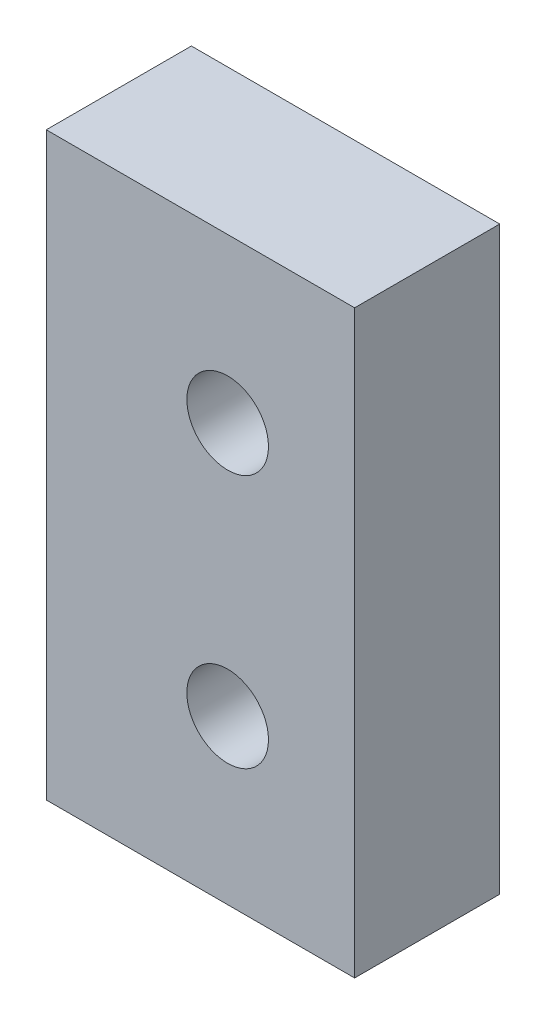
from build123d import *

# Parameters (mm, degrees)
SKETCH_2_W      = 17
SKETCH_2_H      = 32
SKETCH_2_R      = 2.25
EXTRUDE_1_DEPTH = 8


with BuildPart() as part:
    # Sketch 2 → Extrude 1 (new body)
    with BuildSketch(Plane.XY):
        with Locations((8.5, -16)):
            Rectangle(SKETCH_2_W, SKETCH_2_H)
        with Locations((10, -9)):
            Circle(SKETCH_2_R, mode=Mode.SUBTRACT)
        with Locations((10, -23)):
            Circle(SKETCH_2_R, mode=Mode.SUBTRACT)
    extrude(amount=EXTRUDE_1_DEPTH)


solid = part.part
